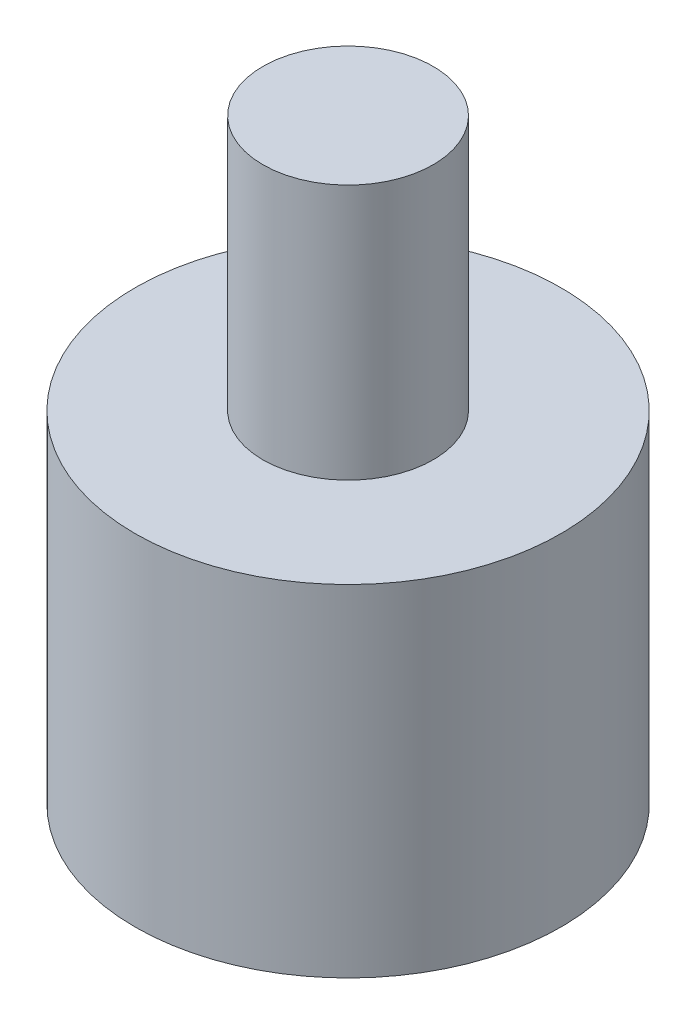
ISO-10303-21;
HEADER;
FILE_DESCRIPTION(('STEP AP214'),'2;1');
FILE_NAME('part.step','',(''),(''),'','','');
FILE_SCHEMA(('AUTOMOTIVE_DESIGN { 1 0 10303 214 1 1 1 1 }'));
ENDSEC;
DATA;
#1=APPLICATION_CONTEXT('core data for automotive mechanical design processes');
#2=APPLICATION_PROTOCOL_DEFINITION('international standard','automotive_design',2000,#1);
#3=PRODUCT_CONTEXT('',#1,'mechanical');
#4=PRODUCT('Part','Part','',(#3));
#5=PRODUCT_RELATED_PRODUCT_CATEGORY('part','',(#4));
#6=PRODUCT_DEFINITION_FORMATION('','',#4);
#7=PRODUCT_DEFINITION_CONTEXT('part definition',#1,'design');
#8=PRODUCT_DEFINITION('design','',#6,#7);
#9=PRODUCT_DEFINITION_SHAPE('','',#8);
#10=(LENGTH_UNIT() NAMED_UNIT(*) SI_UNIT(.MILLI.,.METRE.));
#11=(NAMED_UNIT(*) PLANE_ANGLE_UNIT() SI_UNIT($,.RADIAN.));
#12=(NAMED_UNIT(*) SI_UNIT($,.STERADIAN.) SOLID_ANGLE_UNIT());
#13=UNCERTAINTY_MEASURE_WITH_UNIT(LENGTH_MEASURE(1.E-05),#10,'distance_accuracy_value','');
#14=(GEOMETRIC_REPRESENTATION_CONTEXT(3) GLOBAL_UNCERTAINTY_ASSIGNED_CONTEXT((#13)) GLOBAL_UNIT_ASSIGNED_CONTEXT((#10,
#11,#12)) REPRESENTATION_CONTEXT('',''));
#15=CARTESIAN_POINT('',(0.,0.,0.));
#16=DIRECTION('',(0.,0.,1.));
#17=DIRECTION('',(1.,0.,0.));
#18=AXIS2_PLACEMENT_3D('',#15,#16,#17);
#19=CARTESIAN_POINT('',(0.,8.,0.));
#20=DIRECTION('',(0.,-1.,0.));
#21=DIRECTION('',(0.,0.,-1.));
#22=AXIS2_PLACEMENT_3D('',#19,#20,#21);
#23=CYLINDRICAL_SURFACE('',#22,5.);
#24=CARTESIAN_POINT('',(0.,8.,0.));
#25=DIRECTION('',(0.,1.,0.));
#26=DIRECTION('',(0.,0.,1.));
#27=AXIS2_PLACEMENT_3D('',#24,#25,#26);
#28=CIRCLE('',#27,5.);
#29=CARTESIAN_POINT('',(0.,8.,5.));
#30=VERTEX_POINT('',#29);
#31=EDGE_CURVE('E10',#30,#30,#28,.T.);
#32=ORIENTED_EDGE('',*,*,#31,.F.);
#33=EDGE_LOOP('',(#32));
#34=FACE_BOUND('',#33,.T.);
#35=CARTESIAN_POINT('',(0.,0.,0.));
#36=DIRECTION('',(0.,1.,0.));
#37=DIRECTION('',(0.,0.,1.));
#38=AXIS2_PLACEMENT_3D('',#35,#36,#37);
#39=CIRCLE('',#38,5.);
#40=CARTESIAN_POINT('',(0.,0.,5.));
#41=VERTEX_POINT('',#40);
#42=EDGE_CURVE('E34',#41,#41,#39,.T.);
#43=ORIENTED_EDGE('',*,*,#42,.T.);
#44=EDGE_LOOP('',(#43));
#45=FACE_BOUND('',#44,.T.);
#46=ADVANCED_FACE('F31',(#34,#45),#23,.T.);
#47=CARTESIAN_POINT('',(0.,8.,0.));
#48=DIRECTION('',(0.,1.,0.));
#49=DIRECTION('',(0.,0.,1.));
#50=AXIS2_PLACEMENT_3D('',#47,#48,#49);
#51=PLANE('',#50);
#52=CARTESIAN_POINT('',(0.,8.,0.));
#53=DIRECTION('',(0.,1.,0.));
#54=DIRECTION('',(0.,0.,1.));
#55=AXIS2_PLACEMENT_3D('',#52,#53,#54);
#56=CIRCLE('',#55,2.);
#57=CARTESIAN_POINT('',(0.,8.,2.));
#58=VERTEX_POINT('',#57);
#59=EDGE_CURVE('E43',#58,#58,#56,.T.);
#60=ORIENTED_EDGE('',*,*,#59,.F.);
#61=EDGE_LOOP('',(#60));
#62=FACE_BOUND('',#61,.T.);
#63=ORIENTED_EDGE('',*,*,#31,.T.);
#64=EDGE_LOOP('',(#63));
#65=FACE_BOUND('',#64,.T.);
#66=ADVANCED_FACE('F58',(#62,#65),#51,.T.);
#67=CARTESIAN_POINT('',(0.,0.,0.));
#68=DIRECTION('',(0.,1.,0.));
#69=DIRECTION('',(0.,0.,1.));
#70=AXIS2_PLACEMENT_3D('',#67,#68,#69);
#71=PLANE('',#70);
#72=ORIENTED_EDGE('',*,*,#42,.F.);
#73=EDGE_LOOP('',(#72));
#74=FACE_BOUND('',#73,.T.);
#75=ADVANCED_FACE('F54',(#74),#71,.F.);
#76=CARTESIAN_POINT('',(0.,14.,0.));
#77=DIRECTION('',(0.,-1.,0.));
#78=DIRECTION('',(0.,0.,-1.));
#79=AXIS2_PLACEMENT_3D('',#76,#77,#78);
#80=CYLINDRICAL_SURFACE('',#79,2.);
#81=CARTESIAN_POINT('',(0.,14.,0.));
#82=DIRECTION('',(0.,1.,0.));
#83=DIRECTION('',(0.,0.,1.));
#84=AXIS2_PLACEMENT_3D('',#81,#82,#83);
#85=CIRCLE('',#84,2.);
#86=CARTESIAN_POINT('',(0.,14.,2.));
#87=VERTEX_POINT('',#86);
#88=EDGE_CURVE('E41',#87,#87,#85,.T.);
#89=ORIENTED_EDGE('',*,*,#88,.F.);
#90=EDGE_LOOP('',(#89));
#91=FACE_BOUND('',#90,.T.);
#92=ORIENTED_EDGE('',*,*,#59,.T.);
#93=EDGE_LOOP('',(#92));
#94=FACE_BOUND('',#93,.T.);
#95=ADVANCED_FACE('F51',(#91,#94),#80,.T.);
#96=CARTESIAN_POINT('',(0.,14.,0.));
#97=DIRECTION('',(0.,1.,0.));
#98=DIRECTION('',(0.,0.,1.));
#99=AXIS2_PLACEMENT_3D('',#96,#97,#98);
#100=PLANE('',#99);
#101=ORIENTED_EDGE('',*,*,#88,.T.);
#102=EDGE_LOOP('',(#101));
#103=FACE_BOUND('',#102,.T.);
#104=ADVANCED_FACE('F49',(#103),#100,.T.);
#105=CLOSED_SHELL('',(#46,#66,#75,#95,#104));
#106=MANIFOLD_SOLID_BREP('B2',#105);
#107=ADVANCED_BREP_SHAPE_REPRESENTATION('',(#18,#106),#14);
#108=SHAPE_DEFINITION_REPRESENTATION(#9,#107);
ENDSEC;
END-ISO-10303-21;
